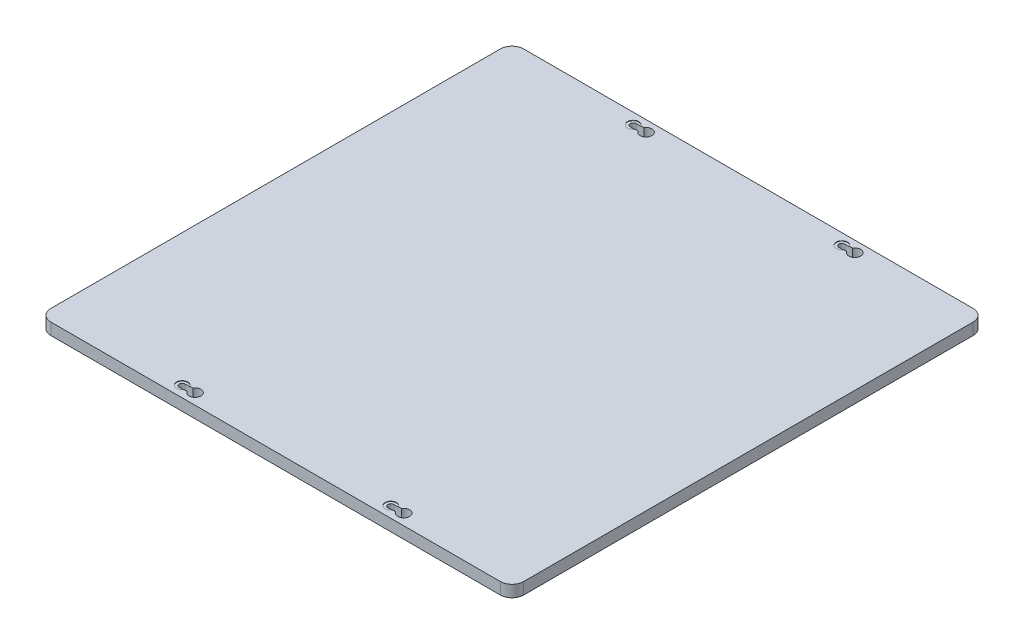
from build123d import *

# Parameters (mm, degrees)
BOSS_EXTRUDE1_DEPTH = 6
CUT_EXTRUDE1_DEPTH  = 172.224998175
CUT_EXTRUDE2_DEPTH  = 172.224998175
CUT_EXTRUDE3_DEPTH  = 172.224998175
CUT_EXTRUDE4_DEPTH  = 172.224998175
SKETCH6_W           = 3
SKETCH6_H           = 6
SKETCH7_W           = 2.85
SKETCH7_H           = 0.2
SKETCH8_W           = 3
SKETCH8_H           = 6
SKETCH9_W           = 2.85
SKETCH9_H           = 0.2
SKETCH10_W          = 3
SKETCH10_H          = 6
SKETCH11_W          = 2.85
SKETCH11_H          = 0.2
SKETCH12_W          = 3
SKETCH12_H          = 6
SKETCH13_W          = 2.85
SKETCH13_H          = 0.2


with BuildPart() as part:
    # Sketch1 → Boss-Extrude1 (new body)
    with BuildSketch(Plane(origin=(0, 3, 0), x_dir=(1, 0, 0), z_dir=(0, 1, 0))):
        with BuildLine():
            Line((-115, -121), (115, -121))
            ThreePointArc((115, -121), (119.242640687, -119.242640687), (121, -115))
            Line((121, -115), (121, 115))
            ThreePointArc((121, 115), (119.242640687, 119.242640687), (115, 121))
            Line((115, 121), (-115, 121))
            ThreePointArc((-115, 121), (-119.242640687, 119.242640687), (-121, 115))
            Line((-121, 115), (-121, -115))
            ThreePointArc((-121, -115), (-119.242640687, -119.242640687), (-115, -121))
        make_face()
    extrude(amount=-BOSS_EXTRUDE1_DEPTH)

    # Sketch2 → Cut-Extrude1 (cut, through all)
    with BuildSketch(Plane(origin=(0, 3, 0), x_dir=(-1, 0, 0), z_dir=(0, 1, 0))):
        with BuildLine():
            Line((-57.401923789, -116.9), (-53.4, -116.9))
            ThreePointArc((-53.4, -116.9), (-51.9, -115.4), (-53.4, -113.9))
            Line((-53.4, -113.9), (-57.401923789, -113.9))
            ThreePointArc((-57.401923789, -113.9), (-57, -115.4), (-57.401923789, -116.9))
        make_face()
    extrude(amount=-CUT_EXTRUDE1_DEPTH, mode=Mode.SUBTRACT)

    # Sketch3 → Cut-Extrude2 (cut, through all)
    with BuildSketch(Plane(origin=(0, 3, 0), x_dir=(-1, 0, 0), z_dir=(0, 1, 0))):
        with BuildLine():
            Line((49.398076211, -116.9), (53.4, -116.9))
            ThreePointArc((53.4, -116.9), (54.9, -115.4), (53.4, -113.9))
            Line((53.4, -113.9), (49.398076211, -113.9))
            ThreePointArc((49.398076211, -113.9), (49.8, -115.4), (49.398076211, -116.9))
        make_face()
    extrude(amount=-CUT_EXTRUDE2_DEPTH, mode=Mode.SUBTRACT)

    # Sketch4 → Cut-Extrude3 (cut, through all)
    with BuildSketch(Plane(origin=(0, 3, 0), x_dir=(-1, 0, 0), z_dir=(0, 1, 0))):
        with BuildLine():
            Line((-57.401923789, 113.9), (-53.4, 113.9))
            ThreePointArc((-53.4, 113.9), (-51.9, 115.4), (-53.4, 116.9))
            Line((-53.4, 116.9), (-57.401923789, 116.9))
            ThreePointArc((-57.401923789, 116.9), (-57, 115.4), (-57.401923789, 113.9))
        make_face()
    extrude(amount=-CUT_EXTRUDE3_DEPTH, mode=Mode.SUBTRACT)

    # Sketch5 → Cut-Extrude4 (cut, through all)
    with BuildSketch(Plane.XZ.offset(3)):
        with BuildLine():
            Line((-53.4, 113.9), (-49.398076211, 113.9))
            ThreePointArc((-49.398076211, 113.9), (-49.8, 115.4), (-49.398076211, 116.9))
            Line((-49.398076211, 116.9), (-53.4, 116.9))
            ThreePointArc((-53.4, 116.9), (-54.9, 115.4), (-53.4, 113.9))
        make_face()
    extrude(amount=-CUT_EXTRUDE4_DEPTH, mode=Mode.SUBTRACT)

    # Sketch6 → Cut-Revolve1 (revolve, cut)
    with BuildSketch(Plane.XY.offset(115.4)):
        with Locations((-45.3, 0)):
            Rectangle(SKETCH6_W, SKETCH6_H)
    revolve(axis=Axis((-46.8, 3, 115.4), (0, -1, 0)), mode=Mode.SUBTRACT)

    # Sketch7 → Cut-Revolve2 (revolve, cut)
    with BuildSketch(Plane(origin=(0, 0, 115.4), x_dir=(-1, 0, 0), z_dir=(0, 0, -1))):
        with Locations((51.975, 2.9)):
            Rectangle(SKETCH7_W, SKETCH7_H)
    revolve(axis=Axis((-53.4, 2.8, 115.4), (0, 1, 0)), mode=Mode.SUBTRACT)

    # Sketch8 → Cut-Revolve3 (revolve, cut)
    with BuildSketch(Plane.XY.offset(115.4)):
        with Locations((61.5, 0)):
            Rectangle(SKETCH8_W, SKETCH8_H)
    revolve(axis=Axis((60, 3, 115.4), (0, -1, 0)), mode=Mode.SUBTRACT)

    # Sketch9 → Cut-Revolve4 (revolve, cut)
    with BuildSketch(Plane(origin=(0, 0, 115.4), x_dir=(-1, 0, 0), z_dir=(0, 0, -1))):
        with Locations((-54.825, 2.9)):
            Rectangle(SKETCH9_W, SKETCH9_H)
    revolve(axis=Axis((53.4, 2.8, 115.4), (0, 1, 0)), mode=Mode.SUBTRACT)

    # Sketch10 → Cut-Revolve5 (revolve, cut)
    with BuildSketch(Plane.XY.offset(-115.4)):
        with Locations((-45.3, 0)):
            Rectangle(SKETCH10_W, SKETCH10_H)
    revolve(axis=Axis((-46.8, 3, -115.4), (0, -1, 0)), mode=Mode.SUBTRACT)

    # Sketch11 → Cut-Revolve6 (revolve, cut)
    with BuildSketch(Plane(origin=(0, 0, -115.4), x_dir=(-1, 0, 0), z_dir=(0, 0, -1))):
        with Locations((51.975, 2.9)):
            Rectangle(SKETCH11_W, SKETCH11_H)
    revolve(axis=Axis((-53.4, 2.8, -115.4), (0, 1, 0)), mode=Mode.SUBTRACT)

    # Sketch12 → Cut-Revolve7 (revolve, cut)
    with BuildSketch(Plane.XY.offset(-115.4)):
        with Locations((61.5, 0)):
            Rectangle(SKETCH12_W, SKETCH12_H)
    revolve(axis=Axis((60, 3, -115.4), (0, -1, 0)), mode=Mode.SUBTRACT)

    # Sketch13 → Cut-Revolve8 (revolve, cut)
    with BuildSketch(Plane(origin=(0, 0, -115.4), x_dir=(-1, 0, 0), z_dir=(0, 0, -1))):
        with Locations((-54.825, 2.9)):
            Rectangle(SKETCH13_W, SKETCH13_H)
    revolve(axis=Axis((53.4, 2.8, -115.4), (0, 1, 0)), mode=Mode.SUBTRACT)


solid = part.part
